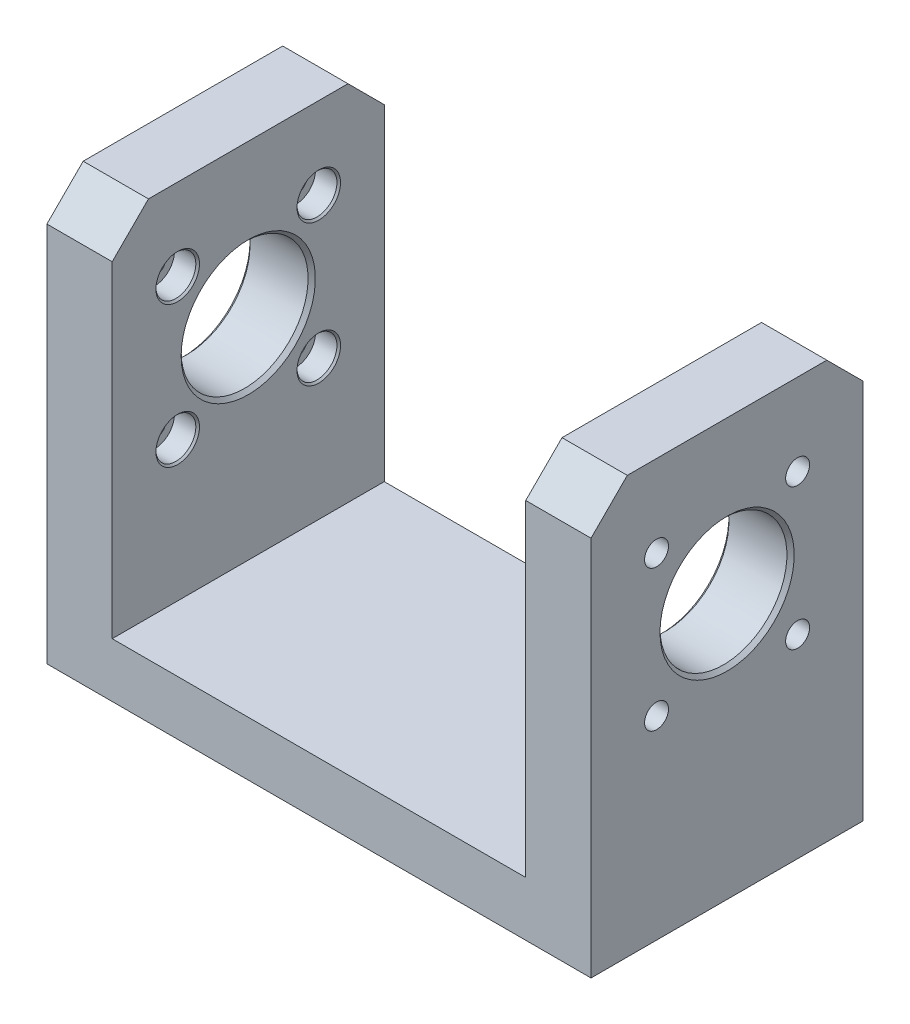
from build123d import *

# Parameters (mm, degrees)
SKETCH1_W                = 150
SKETCH1_H                = 75
BOSS_EXTRUDE1_DEPTH      = 15
SKETCH2_W                = 18
SKETCH2_H                = 75
BOSS_EXTRUDE2_DEPTH      = 100
CUT_EXTRUDE1_REACH       = 194.695
SKETCH3_R                = 17.5
CIRPATTERN1_COUNT        = 4
CHAMFER1_SIZE            = 10
M4_TAPPED_HOLE1_D        = 3.3
M4_TAPPED_HOLE1_DEPTH    = 9.5
M4_TAPPED_HOLE1_TIP      = 0.991420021
CHAMFER2_SIZE            = 1
CHAMFER1_OF_MIRROR2_SIZE = 10
CHAMFER2_OF_MIRROR2_SIZE = 1


with BuildPart() as part:
    # Sketch1 → Boss-Extrude1 (new body)
    with BuildSketch(Plane(origin=(0, 0, 0), x_dir=(1, 0, 0), z_dir=(0, 1, 0))):
        Rectangle(SKETCH1_W, SKETCH1_H)
    extrude(amount=BOSS_EXTRUDE1_DEPTH)

    # Sketch2 → Boss-Extrude2 (add)
    with BuildSketch(Plane(origin=(0, 15, 0), x_dir=(1, 0, 0), z_dir=(0, 1, 0))):
        with Locations((-66, 0)):
            Rectangle(SKETCH2_W, SKETCH2_H)
    boss_extrude2 = extrude(amount=BOSS_EXTRUDE2_DEPTH)

    # Sketch3 → Cut-Extrude1 (cut, up to next)
    with BuildSketch(Plane.ZY.offset(75), mode=Mode.PRIVATE) as cut_extrude1_sk1:
        with Locations((0, 73)):
            Circle(SKETCH3_R)
    cut_extrude1_tool1 = extrude(cut_extrude1_sk1.sketch, amount=-CUT_EXTRUDE1_REACH, mode=Mode.PRIVATE) & part.part
    cut_extrude1 = cut_extrude1_tool1.solids().sort_by_distance((-75, 73, 0))[0]
    add(cut_extrude1, mode=Mode.SUBTRACT)

    # Sketch4 → CBORE for M6 Hex Socket Head Cap Screw1 (revolve, cut)
    with BuildSketch(Plane(origin=(-57, 92.445436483, -19.445436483), x_dir=(0, 0, -1), z_dir=(0, 1, 0))):
        Polygon((0, 0), (0, 18), (3.3, 18), (3.3, 6.4), (5.5, 6.4), (5.5, 0.5), (6, 0), align=None)
    cbore_for_m6_hex_socket_head_cap_screw1 = revolve(axis=Axis((-50.65, 92.445436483, -19.445436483), (-1, 0, 0)), mode=Mode.SUBTRACT)

    # CirPattern1: CBORE for M6 Hex Socket Head Cap Screw1 ×4 about axis
    cirpattern1_axis = Axis((0, 73, 0), (1, 0, 0))
    for i in range(1, CIRPATTERN1_COUNT):
        add(cbore_for_m6_hex_socket_head_cap_screw1.rotate(cirpattern1_axis, i * 360 / CIRPATTERN1_COUNT), mode=Mode.SUBTRACT)

    # Chamfer1
    chamfer1_edges = [part.edges().sort_by_distance(p)[0] for p in [
        (-66, 115, -37.5),
        (-66, 115, 37.5),
    ]]
    chamfer(chamfer1_edges, length=CHAMFER1_SIZE)

    # M4 Tapped Hole1
    with Locations(Plane(origin=(0, 0, -37.5), x_dir=(-1, 0, 0), z_dir=(0, 0, -1))):
        with Locations((61, 95), (61, 25)):
            Hole(M4_TAPPED_HOLE1_D / 2, depth=M4_TAPPED_HOLE1_DEPTH)
            with Locations((0, 0, -(M4_TAPPED_HOLE1_DEPTH + M4_TAPPED_HOLE1_TIP / 2))):  # 118° drill point
                Cone(0, M4_TAPPED_HOLE1_D / 2, M4_TAPPED_HOLE1_TIP, mode=Mode.SUBTRACT)

    # Chamfer2
    chamfer2_edges = [part.edges().sort_by_distance(p)[0] for p in [
        (-75, 73, -17.5),
        (-57, 73, -17.5),
    ]]
    chamfer(chamfer2_edges, length=CHAMFER2_SIZE)

    # Mirror2: Boss-Extrude2, Cut-Extrude1, CBORE for M6 Hex Socket Head Cap Screw1 across plane
    add(boss_extrude2.mirror(Plane(origin=(0, 0, 0), x_dir=(0, 0, 1), z_dir=(1, 0, 0))))
    add(cut_extrude1.mirror(Plane(origin=(0, 0, 0), x_dir=(0, 0, 1), z_dir=(1, 0, 0))), mode=Mode.SUBTRACT)
    add(cbore_for_m6_hex_socket_head_cap_screw1.mirror(Plane(origin=(0, 0, 0), x_dir=(0, 0, 1), z_dir=(1, 0, 0))), mode=Mode.SUBTRACT)

    # Mirror2 copy 1 sketch → Mirror2 copy 1 (revolve, cut)
    with BuildSketch(Plane(origin=(57, 92.445436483, 19.445436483), x_dir=(0, 1, 0), z_dir=(0, 0, 1))):
        Polygon((0, 0), (0, -18), (3.3, -18), (3.3, -6.4), (5.5, -6.4), (5.5, -0.5), (6, 0), align=None)
    revolve(axis=Axis((50.65, 92.445436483, 19.445436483), (-1, 0, 0)), mode=Mode.SUBTRACT)

    # Mirror2 copy 2 sketch → Mirror2 copy 2 (revolve, cut)
    with BuildSketch(Plane(origin=(57, 53.554563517, 19.445436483), x_dir=(0, 0, 1), z_dir=(0, -1, 0))):
        Polygon((0, 0), (0, -18), (3.3, -18), (3.3, -6.4), (5.5, -6.4), (5.5, -0.5), (6, 0), align=None)
    revolve(axis=Axis((50.65, 53.554563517, 19.445436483), (-1, 0, 0)), mode=Mode.SUBTRACT)

    # Mirror2 copy 3 sketch → Mirror2 copy 3 (revolve, cut)
    with BuildSketch(Plane(origin=(57, 53.554563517, -19.445436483), x_dir=(0, -1, 0), z_dir=(0, 0, -1))):
        Polygon((0, 0), (0, -18), (3.3, -18), (3.3, -6.4), (5.5, -6.4), (5.5, -0.5), (6, 0), align=None)
    revolve(axis=Axis((50.65, 53.554563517, -19.445436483), (-1, 0, 0)), mode=Mode.SUBTRACT)

    # Chamfer1 of Mirror2
    chamfer1_of_mirror2_edges = [part.edges().sort_by_distance(p)[0] for p in [
        (66, 115, -37.5),
        (66, 115, 37.5),
    ]]
    chamfer(chamfer1_of_mirror2_edges, length=CHAMFER1_OF_MIRROR2_SIZE)

    # Chamfer2 of Mirror2
    chamfer2_of_mirror2_edges = [part.edges().sort_by_distance(p)[0] for p in [
        (75, 73, -17.5),
        (57, 73, -17.5),
    ]]
    chamfer(chamfer2_of_mirror2_edges, length=CHAMFER2_OF_MIRROR2_SIZE)


solid = part.part
